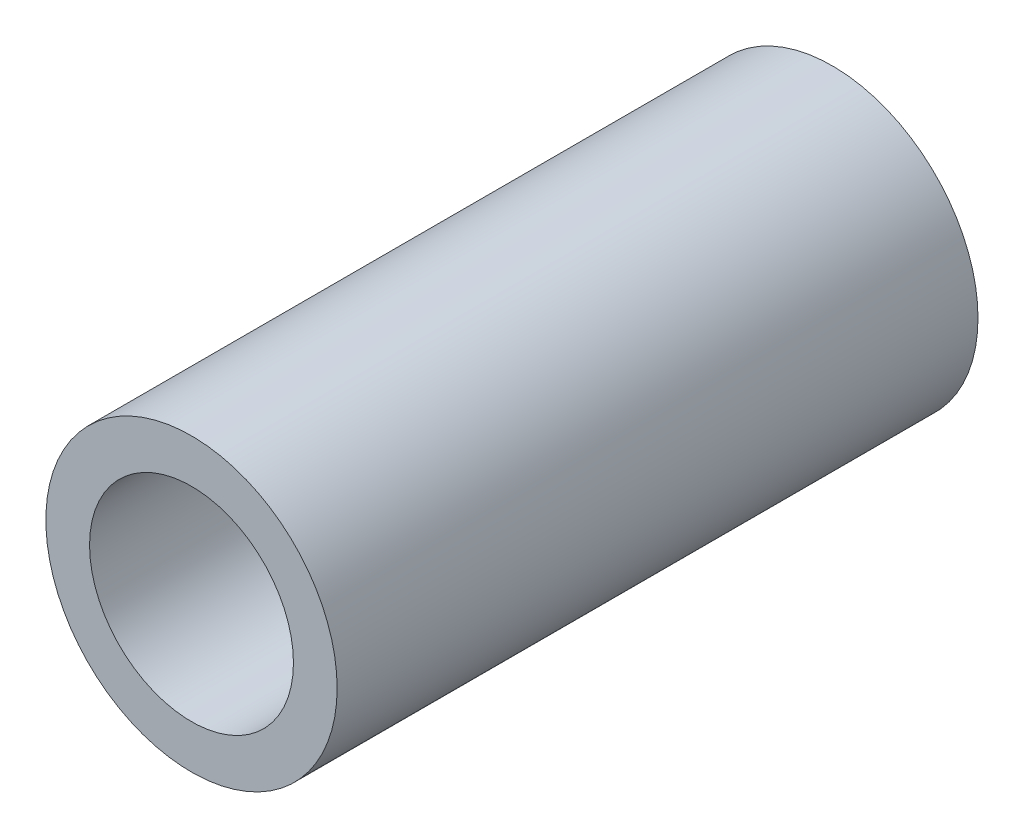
from build123d import *

# Parameters (mm, degrees)
SKETCH1_R           = 2.5
BOSS_EXTRUDE1_DEPTH = 11
SKETCH2_R           = 1.75
CUT_EXTRUDE1_DEPTH  = 4


with BuildPart() as part:
    # Sketch1 → Boss-Extrude1 (new body)
    with BuildSketch(Plane.XY):
        Circle(SKETCH1_R)
    extrude(amount=BOSS_EXTRUDE1_DEPTH)

    # Sketch2 → Cut-Extrude1 (cut)
    with BuildSketch(Plane.XY.offset(11)):
        Circle(SKETCH2_R)
    extrude(amount=-CUT_EXTRUDE1_DEPTH, mode=Mode.SUBTRACT)


solid = part.part
